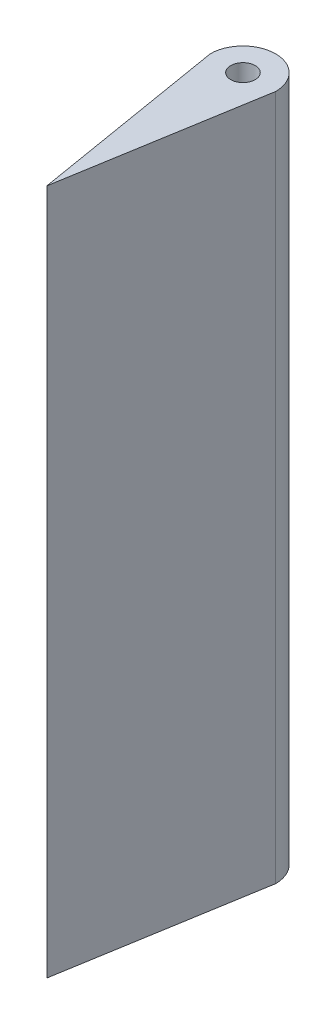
from build123d import *

# Parameters (mm, degrees)
BOSS_EXTRUDE1_DEPTH = 88.9
SKETCH2_R           = 1.5875
CUT_EXTRUDE1_DEPTH  = 93.55426036


with BuildPart() as part:
    # Sketch1 → Boss-Extrude1 (new body)
    with BuildSketch(Plane(origin=(0, 0, 0), x_dir=(1, 0, 0), z_dir=(0, 1, 0))):
        with BuildLine():
            Line((-4.233333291, 0), (0, -25.4))
            Line((0, -25.4), (4.233333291, 0))
            ThreePointArc((4.233333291, 0), (0, 4.233333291), (-4.233333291, 0))
        make_face()
    extrude(amount=BOSS_EXTRUDE1_DEPTH)

    # Sketch2 → Cut-Extrude1 (cut, through all)
    with BuildSketch(Plane(origin=(0, 88.9, 0), x_dir=(1, 0, 0), z_dir=(0, 1, 0))):
        with Locations(Location((0, 0, 0), (0, 0, 270))):
            Circle(SKETCH2_R)
    extrude(amount=-CUT_EXTRUDE1_DEPTH, mode=Mode.SUBTRACT)


solid = part.part
